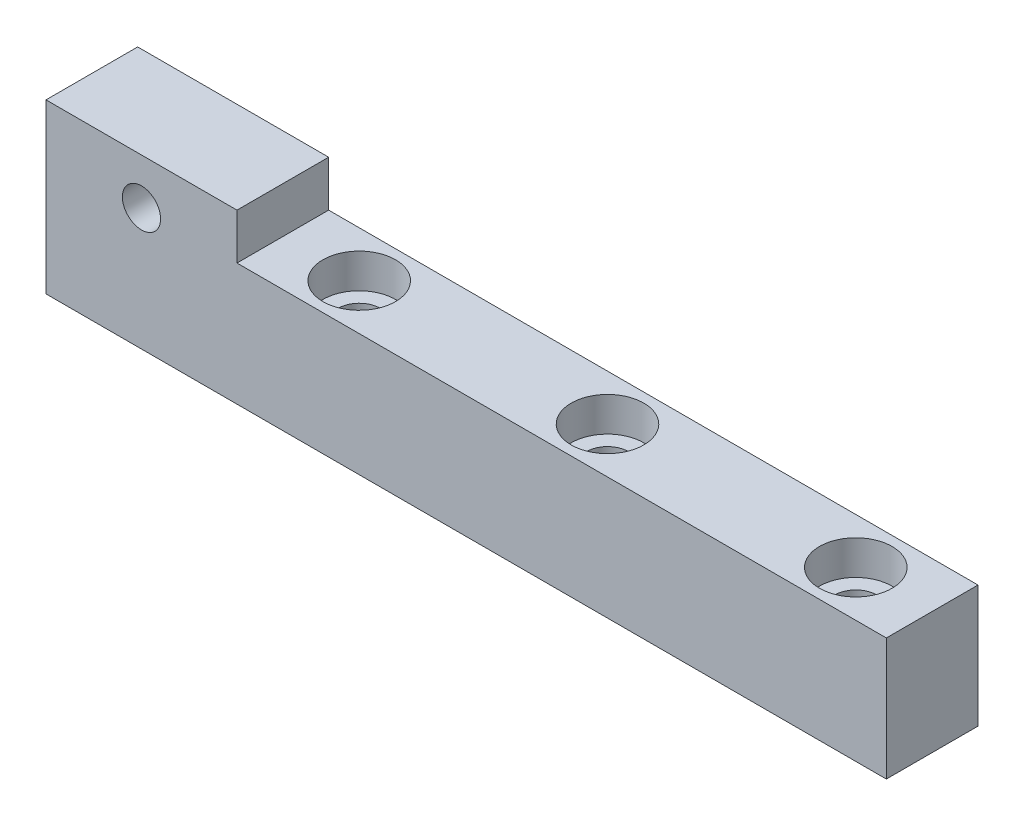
from build123d import *

# Parameters (mm, degrees)
SKETCH_1_R          = 2.5
EXTRUDE_1_DEPTH     = 12
SKETCH_2_R          = 2.75
CUT_EXTRUDE_1_DEPTH = 112.803398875
SKETCH_3_R          = 4.75
CUT_EXTRUDE_2_DEPTH = 4.5


with BuildPart() as part:
    # Sketch 1 → Extrude 1 (new body)
    with BuildSketch(Plane.XY):
        Polygon((110, 0), (110, 16), (25, 16), (25, 22), (0, 22), (0, 0), align=None)
        with Locations((12.5, 16)):
            Circle(SKETCH_1_R, mode=Mode.SUBTRACT)
    extrude(amount=EXTRUDE_1_DEPTH)

    # Sketch 2 → Cut-Extrude 1 (cut, through all)
    with BuildSketch(Plane(origin=(0, 16, 0), x_dir=(1, 0, 0), z_dir=(0, 1, 0))):
        with Locations(Location((100, -6, 0), (0, 0, 270))):
            Circle(SKETCH_2_R)
        with Locations(Location((67.5, -6, 0), (0, 0, 270))):
            Circle(SKETCH_2_R)
        with Locations(Location((35, -6, 0), (0, 0, 270))):
            Circle(SKETCH_2_R)
    extrude(amount=-CUT_EXTRUDE_1_DEPTH, mode=Mode.SUBTRACT)

    # Sketch 3 → Cut-Extrude 2 (cut)
    with BuildSketch(Plane(origin=(0, 16, 0), x_dir=(1, 0, 0), z_dir=(0, 1, 0))):
        with Locations(Location((100, -6, 0), (0, 0, 270))):
            Circle(SKETCH_3_R)
        with Locations(Location((67.5, -6, 0), (0, 0, 270))):
            Circle(SKETCH_3_R)
        with Locations(Location((35, -6, 0), (0, 0, 270))):
            Circle(SKETCH_3_R)
    extrude(amount=-CUT_EXTRUDE_2_DEPTH, mode=Mode.SUBTRACT)


solid = part.part
